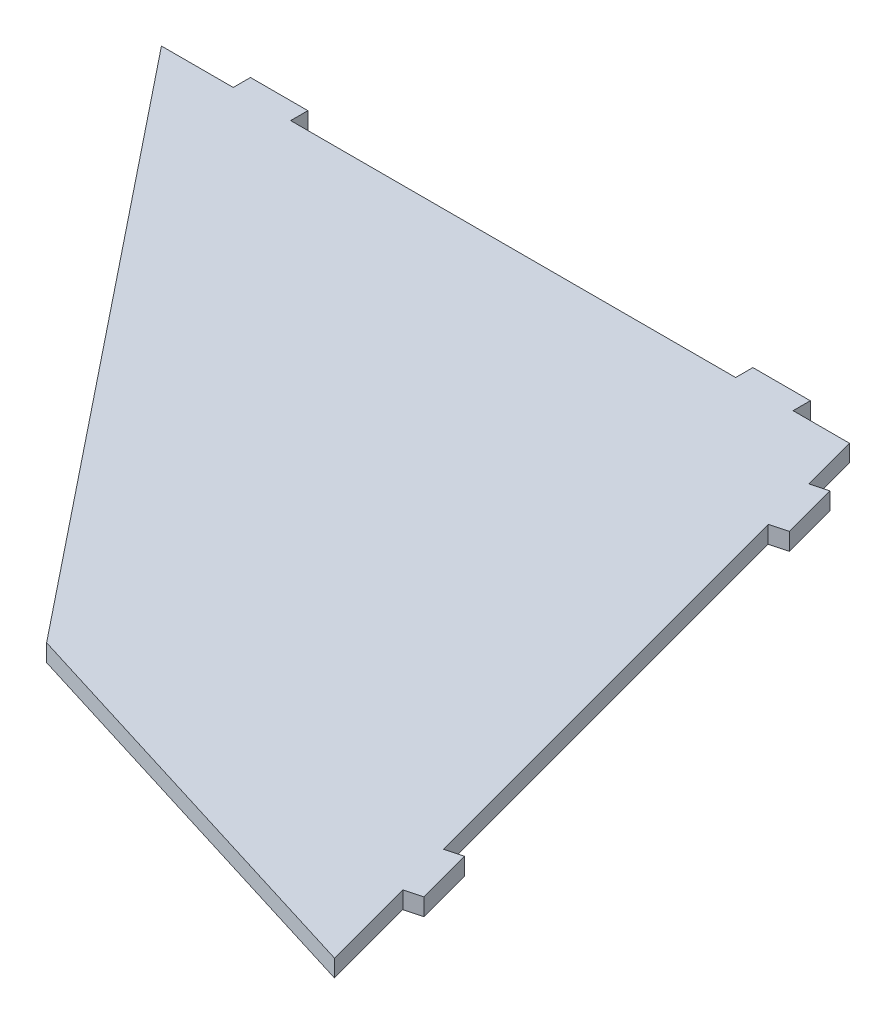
ISO-10303-21;
HEADER;
FILE_DESCRIPTION(('STEP AP214'),'2;1');
FILE_NAME('part.step','',(''),(''),'','','');
FILE_SCHEMA(('AUTOMOTIVE_DESIGN { 1 0 10303 214 1 1 1 1 }'));
ENDSEC;
DATA;
#1=APPLICATION_CONTEXT('core data for automotive mechanical design processes');
#2=APPLICATION_PROTOCOL_DEFINITION('international standard','automotive_design',2000,#1);
#3=PRODUCT_CONTEXT('',#1,'mechanical');
#4=PRODUCT('Part','Part','',(#3));
#5=PRODUCT_RELATED_PRODUCT_CATEGORY('part','',(#4));
#6=PRODUCT_DEFINITION_FORMATION('','',#4);
#7=PRODUCT_DEFINITION_CONTEXT('part definition',#1,'design');
#8=PRODUCT_DEFINITION('design','',#6,#7);
#9=PRODUCT_DEFINITION_SHAPE('','',#8);
#10=(LENGTH_UNIT() NAMED_UNIT(*) SI_UNIT(.MILLI.,.METRE.));
#11=(NAMED_UNIT(*) PLANE_ANGLE_UNIT() SI_UNIT($,.RADIAN.));
#12=(NAMED_UNIT(*) SI_UNIT($,.STERADIAN.) SOLID_ANGLE_UNIT());
#13=UNCERTAINTY_MEASURE_WITH_UNIT(LENGTH_MEASURE(1.E-05),#10,'distance_accuracy_value','');
#14=(GEOMETRIC_REPRESENTATION_CONTEXT(3) GLOBAL_UNCERTAINTY_ASSIGNED_CONTEXT((#13)) GLOBAL_UNIT_ASSIGNED_CONTEXT((#10,
#11,#12)) REPRESENTATION_CONTEXT('',''));
#15=CARTESIAN_POINT('',(0.,0.,0.));
#16=DIRECTION('',(0.,0.,1.));
#17=DIRECTION('',(1.,0.,0.));
#18=AXIS2_PLACEMENT_3D('',#15,#16,#17);
#19=CARTESIAN_POINT('',(90.5871781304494,6.,17.7656022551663));
#20=DIRECTION('',(0.258819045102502,0.,0.965925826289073));
#21=DIRECTION('',(0.965925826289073,0.,-0.258819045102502));
#22=AXIS2_PLACEMENT_3D('',#19,#20,#21);
#23=PLANE('',#22);
#24=DIRECTION('',(-0.965925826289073,0.,0.258819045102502));
#25=VECTOR('',#24,1.);
#26=CARTESIAN_POINT('',(90.5871781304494,0.,17.7656022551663));
#27=LINE('',#26,#25);
#28=CARTESIAN_POINT('',(90.5871781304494,0.,17.7656022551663));
#29=VERTEX_POINT('',#28);
#30=CARTESIAN_POINT('',(84.791623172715,0.,19.3185165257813));
#31=VERTEX_POINT('',#30);
#32=EDGE_CURVE('E201',#29,#31,#27,.T.);
#33=ORIENTED_EDGE('',*,*,#32,.T.);
#34=DIRECTION('',(0.,-1.,0.));
#35=VECTOR('',#34,1.);
#36=CARTESIAN_POINT('',(84.791623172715,6.,19.3185165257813));
#37=LINE('',#36,#35);
#38=CARTESIAN_POINT('',(84.791623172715,6.,19.3185165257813));
#39=VERTEX_POINT('',#38);
#40=EDGE_CURVE('E11',#39,#31,#37,.T.);
#41=ORIENTED_EDGE('',*,*,#40,.F.);
#42=DIRECTION('',(-0.965925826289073,0.,0.258819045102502));
#43=VECTOR('',#42,1.);
#44=CARTESIAN_POINT('',(90.5871781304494,6.,17.7656022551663));
#45=LINE('',#44,#43);
#46=CARTESIAN_POINT('',(90.5871781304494,6.,17.7656022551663));
#47=VERTEX_POINT('',#46);
#48=EDGE_CURVE('E239',#47,#39,#45,.T.);
#49=ORIENTED_EDGE('',*,*,#48,.F.);
#50=DIRECTION('',(0.,-1.,0.));
#51=VECTOR('',#50,1.);
#52=CARTESIAN_POINT('',(90.5871781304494,6.,17.7656022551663));
#53=LINE('',#52,#51);
#54=EDGE_CURVE('E197',#47,#29,#53,.T.);
#55=ORIENTED_EDGE('',*,*,#54,.T.);
#56=EDGE_LOOP('',(#33,#41,#49,#55));
#57=FACE_BOUND('',#56,.T.);
#58=ADVANCED_FACE('F33',(#57),#23,.F.);
#59=CARTESIAN_POINT('',(84.791623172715,6.,19.3185165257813));
#60=DIRECTION('',(-0.965925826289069,0.,0.258819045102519));
#61=DIRECTION('',(0.258819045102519,0.,0.965925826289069));
#62=AXIS2_PLACEMENT_3D('',#59,#60,#61);
#63=PLANE('',#62);
#64=DIRECTION('',(-0.258819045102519,0.,-0.965925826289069));
#65=VECTOR('',#64,1.);
#66=CARTESIAN_POINT('',(84.791623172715,0.,19.3185165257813));
#67=LINE('',#66,#65);
#68=CARTESIAN_POINT('',(79.6152422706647,0.,0.));
#69=VERTEX_POINT('',#68);
#70=EDGE_CURVE('E204',#31,#69,#67,.T.);
#71=ORIENTED_EDGE('',*,*,#70,.T.);
#72=DIRECTION('',(0.,-1.,0.));
#73=VECTOR('',#72,1.);
#74=CARTESIAN_POINT('',(79.6152422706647,6.,0.));
#75=LINE('',#74,#73);
#76=CARTESIAN_POINT('',(79.6152422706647,6.,0.));
#77=VERTEX_POINT('',#76);
#78=EDGE_CURVE('E41',#77,#69,#75,.T.);
#79=ORIENTED_EDGE('',*,*,#78,.F.);
#80=DIRECTION('',(-0.258819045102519,0.,-0.965925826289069));
#81=VECTOR('',#80,1.);
#82=CARTESIAN_POINT('',(84.791623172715,6.,19.3185165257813));
#83=LINE('',#82,#81);
#84=EDGE_CURVE('E128',#39,#77,#83,.T.);
#85=ORIENTED_EDGE('',*,*,#84,.F.);
#86=ORIENTED_EDGE('',*,*,#40,.T.);
#87=EDGE_LOOP('',(#71,#79,#85,#86));
#88=FACE_BOUND('',#87,.T.);
#89=ADVANCED_FACE('F357',(#88),#63,.F.);
#90=CARTESIAN_POINT('',(60.,6.,0.));
#91=DIRECTION('',(0.,0.,1.));
#92=DIRECTION('',(1.,0.,0.));
#93=AXIS2_PLACEMENT_3D('',#90,#91,#92);
#94=PLANE('',#93);
#95=DIRECTION('',(-1.,0.,0.));
#96=VECTOR('',#95,1.);
#97=CARTESIAN_POINT('',(60.,0.,0.));
#98=LINE('',#97,#96);
#99=CARTESIAN_POINT('',(60.,0.,0.));
#100=VERTEX_POINT('',#99);
#101=EDGE_CURVE('E206',#69,#100,#98,.T.);
#102=ORIENTED_EDGE('',*,*,#101,.T.);
#103=DIRECTION('',(0.,-1.,0.));
#104=VECTOR('',#103,1.);
#105=CARTESIAN_POINT('',(60.,6.,0.));
#106=LINE('',#105,#104);
#107=CARTESIAN_POINT('',(60.,6.,0.));
#108=VERTEX_POINT('',#107);
#109=EDGE_CURVE('E282',#108,#100,#106,.T.);
#110=ORIENTED_EDGE('',*,*,#109,.F.);
#111=DIRECTION('',(-1.,0.,0.));
#112=VECTOR('',#111,1.);
#113=CARTESIAN_POINT('',(60.,6.,0.));
#114=LINE('',#113,#112);
#115=EDGE_CURVE('E290',#77,#108,#114,.T.);
#116=ORIENTED_EDGE('',*,*,#115,.F.);
#117=ORIENTED_EDGE('',*,*,#78,.T.);
#118=EDGE_LOOP('',(#102,#110,#116,#117));
#119=FACE_BOUND('',#118,.T.);
#120=ADVANCED_FACE('F288',(#119),#94,.F.);
#121=CARTESIAN_POINT('',(60.,6.,0.));
#122=DIRECTION('',(-1.,0.,0.));
#123=DIRECTION('',(0.,0.,1.));
#124=AXIS2_PLACEMENT_3D('',#121,#122,#123);
#125=PLANE('',#124);
#126=DIRECTION('',(0.,0.,-1.));
#127=VECTOR('',#126,1.);
#128=CARTESIAN_POINT('',(60.,0.,0.));
#129=LINE('',#128,#127);
#130=CARTESIAN_POINT('',(60.,0.,-6.));
#131=VERTEX_POINT('',#130);
#132=EDGE_CURVE('E208',#100,#131,#129,.T.);
#133=ORIENTED_EDGE('',*,*,#132,.T.);
#134=DIRECTION('',(0.,-1.,0.));
#135=VECTOR('',#134,1.);
#136=CARTESIAN_POINT('',(60.,6.,-6.));
#137=LINE('',#136,#135);
#138=CARTESIAN_POINT('',(60.,6.,-6.));
#139=VERTEX_POINT('',#138);
#140=EDGE_CURVE('E279',#139,#131,#137,.T.);
#141=ORIENTED_EDGE('',*,*,#140,.F.);
#142=DIRECTION('',(0.,0.,-1.));
#143=VECTOR('',#142,1.);
#144=CARTESIAN_POINT('',(60.,6.,0.));
#145=LINE('',#144,#143);
#146=EDGE_CURVE('E308',#108,#139,#145,.T.);
#147=ORIENTED_EDGE('',*,*,#146,.F.);
#148=ORIENTED_EDGE('',*,*,#109,.T.);
#149=EDGE_LOOP('',(#133,#141,#147,#148));
#150=FACE_BOUND('',#149,.T.);
#151=ADVANCED_FACE('F299',(#150),#125,.F.);
#152=CARTESIAN_POINT('',(60.,6.,-6.));
#153=DIRECTION('',(0.,0.,1.));
#154=DIRECTION('',(1.,0.,0.));
#155=AXIS2_PLACEMENT_3D('',#152,#153,#154);
#156=PLANE('',#155);
#157=DIRECTION('',(-1.,0.,0.));
#158=VECTOR('',#157,1.);
#159=CARTESIAN_POINT('',(60.,0.,-6.));
#160=LINE('',#159,#158);
#161=CARTESIAN_POINT('',(40.,0.,-6.));
#162=VERTEX_POINT('',#161);
#163=EDGE_CURVE('E210',#131,#162,#160,.T.);
#164=ORIENTED_EDGE('',*,*,#163,.T.);
#165=DIRECTION('',(0.,-1.,0.));
#166=VECTOR('',#165,1.);
#167=CARTESIAN_POINT('',(40.,6.,-6.));
#168=LINE('',#167,#166);
#169=CARTESIAN_POINT('',(40.,6.,-6.));
#170=VERTEX_POINT('',#169);
#171=EDGE_CURVE('E276',#170,#162,#168,.T.);
#172=ORIENTED_EDGE('',*,*,#171,.F.);
#173=DIRECTION('',(-1.,0.,0.));
#174=VECTOR('',#173,1.);
#175=CARTESIAN_POINT('',(60.,6.,-6.));
#176=LINE('',#175,#174);
#177=EDGE_CURVE('E305',#139,#170,#176,.T.);
#178=ORIENTED_EDGE('',*,*,#177,.F.);
#179=ORIENTED_EDGE('',*,*,#140,.T.);
#180=EDGE_LOOP('',(#164,#172,#178,#179));
#181=FACE_BOUND('',#180,.T.);
#182=ADVANCED_FACE('F303',(#181),#156,.F.);
#183=CARTESIAN_POINT('',(40.,6.,0.));
#184=DIRECTION('',(1.,0.,0.));
#185=DIRECTION('',(0.,0.,-1.));
#186=AXIS2_PLACEMENT_3D('',#183,#184,#185);
#187=PLANE('',#186);
#188=DIRECTION('',(0.,0.,1.));
#189=VECTOR('',#188,1.);
#190=CARTESIAN_POINT('',(40.,0.,0.));
#191=LINE('',#190,#189);
#192=CARTESIAN_POINT('',(40.,0.,0.));
#193=VERTEX_POINT('',#192);
#194=EDGE_CURVE('E212',#162,#193,#191,.T.);
#195=ORIENTED_EDGE('',*,*,#194,.T.);
#196=DIRECTION('',(0.,-1.,0.));
#197=VECTOR('',#196,1.);
#198=CARTESIAN_POINT('',(40.,6.,0.));
#199=LINE('',#198,#197);
#200=CARTESIAN_POINT('',(40.,6.,0.));
#201=VERTEX_POINT('',#200);
#202=EDGE_CURVE('E273',#201,#193,#199,.T.);
#203=ORIENTED_EDGE('',*,*,#202,.F.);
#204=DIRECTION('',(0.,0.,1.));
#205=VECTOR('',#204,1.);
#206=CARTESIAN_POINT('',(40.,6.,0.));
#207=LINE('',#206,#205);
#208=EDGE_CURVE('E307',#170,#201,#207,.T.);
#209=ORIENTED_EDGE('',*,*,#208,.F.);
#210=ORIENTED_EDGE('',*,*,#171,.T.);
#211=EDGE_LOOP('',(#195,#203,#209,#210));
#212=FACE_BOUND('',#211,.T.);
#213=ADVANCED_FACE('F370',(#212),#187,.F.);
#214=CARTESIAN_POINT('',(-115.,6.,0.));
#215=DIRECTION('',(0.,0.,1.));
#216=DIRECTION('',(1.,0.,0.));
#217=AXIS2_PLACEMENT_3D('',#214,#215,#216);
#218=PLANE('',#217);
#219=DIRECTION('',(-1.,0.,0.));
#220=VECTOR('',#219,1.);
#221=CARTESIAN_POINT('',(-115.,0.,0.));
#222=LINE('',#221,#220);
#223=CARTESIAN_POINT('',(-115.,0.,0.));
#224=VERTEX_POINT('',#223);
#225=EDGE_CURVE('E214',#193,#224,#222,.T.);
#226=ORIENTED_EDGE('',*,*,#225,.T.);
#227=DIRECTION('',(0.,-1.,0.));
#228=VECTOR('',#227,1.);
#229=CARTESIAN_POINT('',(-115.,6.,0.));
#230=LINE('',#229,#228);
#231=CARTESIAN_POINT('',(-115.,6.,0.));
#232=VERTEX_POINT('',#231);
#233=EDGE_CURVE('E270',#232,#224,#230,.T.);
#234=ORIENTED_EDGE('',*,*,#233,.F.);
#235=DIRECTION('',(-1.,0.,0.));
#236=VECTOR('',#235,1.);
#237=CARTESIAN_POINT('',(-115.,6.,0.));
#238=LINE('',#237,#236);
#239=EDGE_CURVE('E310',#201,#232,#238,.T.);
#240=ORIENTED_EDGE('',*,*,#239,.F.);
#241=ORIENTED_EDGE('',*,*,#202,.T.);
#242=EDGE_LOOP('',(#226,#234,#240,#241));
#243=FACE_BOUND('',#242,.T.);
#244=ADVANCED_FACE('F373',(#243),#218,.F.);
#245=CARTESIAN_POINT('',(-115.,6.,0.));
#246=DIRECTION('',(-1.,0.,0.));
#247=DIRECTION('',(0.,0.,1.));
#248=AXIS2_PLACEMENT_3D('',#245,#246,#247);
#249=PLANE('',#248);
#250=DIRECTION('',(0.,0.,-1.));
#251=VECTOR('',#250,1.);
#252=CARTESIAN_POINT('',(-115.,0.,0.));
#253=LINE('',#252,#251);
#254=CARTESIAN_POINT('',(-115.,0.,-5.99999999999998));
#255=VERTEX_POINT('',#254);
#256=EDGE_CURVE('E216',#224,#255,#253,.T.);
#257=ORIENTED_EDGE('',*,*,#256,.T.);
#258=DIRECTION('',(0.,-1.,0.));
#259=VECTOR('',#258,1.);
#260=CARTESIAN_POINT('',(-115.,6.,-5.99999999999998));
#261=LINE('',#260,#259);
#262=CARTESIAN_POINT('',(-115.,6.,-5.99999999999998));
#263=VERTEX_POINT('',#262);
#264=EDGE_CURVE('E267',#263,#255,#261,.T.);
#265=ORIENTED_EDGE('',*,*,#264,.F.);
#266=DIRECTION('',(0.,0.,-1.));
#267=VECTOR('',#266,1.);
#268=CARTESIAN_POINT('',(-115.,6.,0.));
#269=LINE('',#268,#267);
#270=EDGE_CURVE('E316',#232,#263,#269,.T.);
#271=ORIENTED_EDGE('',*,*,#270,.F.);
#272=ORIENTED_EDGE('',*,*,#233,.T.);
#273=EDGE_LOOP('',(#257,#265,#271,#272));
#274=FACE_BOUND('',#273,.T.);
#275=ADVANCED_FACE('F377',(#274),#249,.F.);
#276=CARTESIAN_POINT('',(-135.,6.,-5.99999999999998));
#277=DIRECTION('',(0.,0.,1.));
#278=DIRECTION('',(1.,0.,0.));
#279=AXIS2_PLACEMENT_3D('',#276,#277,#278);
#280=PLANE('',#279);
#281=DIRECTION('',(-1.,0.,0.));
#282=VECTOR('',#281,1.);
#283=CARTESIAN_POINT('',(-135.,0.,-5.99999999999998));
#284=LINE('',#283,#282);
#285=CARTESIAN_POINT('',(-135.,0.,-5.99999999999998));
#286=VERTEX_POINT('',#285);
#287=EDGE_CURVE('E218',#255,#286,#284,.T.);
#288=ORIENTED_EDGE('',*,*,#287,.T.);
#289=DIRECTION('',(0.,-1.,0.));
#290=VECTOR('',#289,1.);
#291=CARTESIAN_POINT('',(-135.,6.,-5.99999999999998));
#292=LINE('',#291,#290);
#293=CARTESIAN_POINT('',(-135.,6.,-5.99999999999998));
#294=VERTEX_POINT('',#293);
#295=EDGE_CURVE('E264',#294,#286,#292,.T.);
#296=ORIENTED_EDGE('',*,*,#295,.F.);
#297=DIRECTION('',(-1.,0.,0.));
#298=VECTOR('',#297,1.);
#299=CARTESIAN_POINT('',(-135.,6.,-5.99999999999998));
#300=LINE('',#299,#298);
#301=EDGE_CURVE('E318',#263,#294,#300,.T.);
#302=ORIENTED_EDGE('',*,*,#301,.F.);
#303=ORIENTED_EDGE('',*,*,#264,.T.);
#304=EDGE_LOOP('',(#288,#296,#302,#303));
#305=FACE_BOUND('',#304,.T.);
#306=ADVANCED_FACE('F381',(#305),#280,.F.);
#307=CARTESIAN_POINT('',(-135.,6.,0.));
#308=DIRECTION('',(1.,0.,0.));
#309=DIRECTION('',(0.,0.,-1.));
#310=AXIS2_PLACEMENT_3D('',#307,#308,#309);
#311=PLANE('',#310);
#312=DIRECTION('',(0.,0.,1.));
#313=VECTOR('',#312,1.);
#314=CARTESIAN_POINT('',(-135.,0.,0.));
#315=LINE('',#314,#313);
#316=CARTESIAN_POINT('',(-135.,0.,0.));
#317=VERTEX_POINT('',#316);
#318=EDGE_CURVE('E220',#286,#317,#315,.T.);
#319=ORIENTED_EDGE('',*,*,#318,.T.);
#320=DIRECTION('',(0.,-1.,0.));
#321=VECTOR('',#320,1.);
#322=CARTESIAN_POINT('',(-135.,6.,0.));
#323=LINE('',#322,#321);
#324=CARTESIAN_POINT('',(-135.,6.,0.));
#325=VERTEX_POINT('',#324);
#326=EDGE_CURVE('E261',#325,#317,#323,.T.);
#327=ORIENTED_EDGE('',*,*,#326,.F.);
#328=DIRECTION('',(0.,0.,1.));
#329=VECTOR('',#328,1.);
#330=CARTESIAN_POINT('',(-135.,6.,0.));
#331=LINE('',#330,#329);
#332=EDGE_CURVE('E320',#294,#325,#331,.T.);
#333=ORIENTED_EDGE('',*,*,#332,.F.);
#334=ORIENTED_EDGE('',*,*,#295,.T.);
#335=EDGE_LOOP('',(#319,#327,#333,#334));
#336=FACE_BOUND('',#335,.T.);
#337=ADVANCED_FACE('F385',(#336),#311,.F.);
#338=CARTESIAN_POINT('',(-160.,6.,0.));
#339=DIRECTION('',(0.,0.,1.));
#340=DIRECTION('',(1.,0.,0.));
#341=AXIS2_PLACEMENT_3D('',#338,#339,#340);
#342=PLANE('',#341);
#343=DIRECTION('',(-1.,0.,0.));
#344=VECTOR('',#343,1.);
#345=CARTESIAN_POINT('',(-160.,0.,0.));
#346=LINE('',#345,#344);
#347=CARTESIAN_POINT('',(-160.,0.,0.));
#348=VERTEX_POINT('',#347);
#349=EDGE_CURVE('E222',#317,#348,#346,.T.);
#350=ORIENTED_EDGE('',*,*,#349,.T.);
#351=DIRECTION('',(0.,-1.,0.));
#352=VECTOR('',#351,1.);
#353=CARTESIAN_POINT('',(-160.,6.,0.));
#354=LINE('',#353,#352);
#355=CARTESIAN_POINT('',(-160.,6.,0.));
#356=VERTEX_POINT('',#355);
#357=EDGE_CURVE('E258',#356,#348,#354,.T.);
#358=ORIENTED_EDGE('',*,*,#357,.F.);
#359=DIRECTION('',(-1.,0.,0.));
#360=VECTOR('',#359,1.);
#361=CARTESIAN_POINT('',(-160.,6.,0.));
#362=LINE('',#361,#360);
#363=EDGE_CURVE('E322',#325,#356,#362,.T.);
#364=ORIENTED_EDGE('',*,*,#363,.F.);
#365=ORIENTED_EDGE('',*,*,#326,.T.);
#366=EDGE_LOOP('',(#350,#358,#364,#365));
#367=FACE_BOUND('',#366,.T.);
#368=ADVANCED_FACE('F389',(#367),#342,.F.);
#369=CARTESIAN_POINT('',(-160.,6.,0.));
#370=DIRECTION('',(0.78086880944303,0.,-0.624695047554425));
#371=DIRECTION('',(-0.624695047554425,0.,-0.78086880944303));
#372=AXIS2_PLACEMENT_3D('',#369,#370,#371);
#373=PLANE('',#372);
#374=DIRECTION('',(0.624695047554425,0.,0.78086880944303));
#375=VECTOR('',#374,1.);
#376=CARTESIAN_POINT('',(-160.,0.,0.));
#377=LINE('',#376,#375);
#378=CARTESIAN_POINT('',(0.,0.,200.));
#379=VERTEX_POINT('',#378);
#380=EDGE_CURVE('E224',#348,#379,#377,.T.);
#381=ORIENTED_EDGE('',*,*,#380,.T.);
#382=DIRECTION('',(0.,-1.,0.));
#383=VECTOR('',#382,1.);
#384=CARTESIAN_POINT('',(0.,6.,200.));
#385=LINE('',#384,#383);
#386=CARTESIAN_POINT('',(0.,6.,200.));
#387=VERTEX_POINT('',#386);
#388=EDGE_CURVE('E255',#387,#379,#385,.T.);
#389=ORIENTED_EDGE('',*,*,#388,.F.);
#390=DIRECTION('',(0.624695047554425,0.,0.78086880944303));
#391=VECTOR('',#390,1.);
#392=CARTESIAN_POINT('',(-160.,6.,0.));
#393=LINE('',#392,#391);
#394=EDGE_CURVE('E324',#356,#387,#393,.T.);
#395=ORIENTED_EDGE('',*,*,#394,.F.);
#396=ORIENTED_EDGE('',*,*,#357,.T.);
#397=EDGE_LOOP('',(#381,#389,#395,#396));
#398=FACE_BOUND('',#397,.T.);
#399=ADVANCED_FACE('F393',(#398),#373,.F.);
#400=CARTESIAN_POINT('',(0.,6.,200.));
#401=DIRECTION('',(0.295909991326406,0.,-0.95521582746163));
#402=DIRECTION('',(-0.95521582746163,0.,-0.295909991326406));
#403=AXIS2_PLACEMENT_3D('',#400,#401,#402);
#404=PLANE('',#403);
#405=DIRECTION('',(0.95521582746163,0.,0.295909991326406));
#406=VECTOR('',#405,1.);
#407=CARTESIAN_POINT('',(0.,0.,200.));
#408=LINE('',#407,#406);
#409=CARTESIAN_POINT('',(145.262794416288,0.,245.));
#410=VERTEX_POINT('',#409);
#411=EDGE_CURVE('E226',#379,#410,#408,.T.);
#412=ORIENTED_EDGE('',*,*,#411,.T.);
#413=DIRECTION('',(0.,-1.,0.));
#414=VECTOR('',#413,1.);
#415=CARTESIAN_POINT('',(145.262794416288,6.,245.));
#416=LINE('',#415,#414);
#417=CARTESIAN_POINT('',(145.262794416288,6.,245.));
#418=VERTEX_POINT('',#417);
#419=EDGE_CURVE('E252',#418,#410,#416,.T.);
#420=ORIENTED_EDGE('',*,*,#419,.F.);
#421=DIRECTION('',(0.95521582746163,0.,0.295909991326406));
#422=VECTOR('',#421,1.);
#423=CARTESIAN_POINT('',(0.,6.,200.));
#424=LINE('',#423,#422);
#425=EDGE_CURVE('E326',#387,#418,#424,.T.);
#426=ORIENTED_EDGE('',*,*,#425,.F.);
#427=ORIENTED_EDGE('',*,*,#388,.T.);
#428=EDGE_LOOP('',(#412,#420,#426,#427));
#429=FACE_BOUND('',#428,.T.);
#430=ADVANCED_FACE('F397',(#429),#404,.F.);
#431=CARTESIAN_POINT('',(145.262794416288,6.,245.));
#432=DIRECTION('',(-0.965925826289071,0.,0.258819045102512));
#433=DIRECTION('',(0.258819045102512,0.,0.965925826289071));
#434=AXIS2_PLACEMENT_3D('',#431,#432,#433);
#435=PLANE('',#434);
#436=DIRECTION('',(-0.258819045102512,0.,-0.965925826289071));
#437=VECTOR('',#436,1.);
#438=CARTESIAN_POINT('',(145.262794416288,0.,245.));
#439=LINE('',#438,#437);
#440=CARTESIAN_POINT('',(136.555432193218,0.,212.503681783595));
#441=VERTEX_POINT('',#440);
#442=EDGE_CURVE('E228',#410,#441,#439,.T.);
#443=ORIENTED_EDGE('',*,*,#442,.T.);
#444=DIRECTION('',(0.,-1.,0.));
#445=VECTOR('',#444,1.);
#446=CARTESIAN_POINT('',(136.555432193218,6.,212.503681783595));
#447=LINE('',#446,#445);
#448=CARTESIAN_POINT('',(136.555432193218,6.,212.503681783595));
#449=VERTEX_POINT('',#448);
#450=EDGE_CURVE('E249',#449,#441,#447,.T.);
#451=ORIENTED_EDGE('',*,*,#450,.F.);
#452=DIRECTION('',(-0.258819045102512,0.,-0.965925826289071));
#453=VECTOR('',#452,1.);
#454=CARTESIAN_POINT('',(145.262794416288,6.,245.));
#455=LINE('',#454,#453);
#456=EDGE_CURVE('E328',#418,#449,#455,.T.);
#457=ORIENTED_EDGE('',*,*,#456,.F.);
#458=ORIENTED_EDGE('',*,*,#419,.T.);
#459=EDGE_LOOP('',(#443,#451,#457,#458));
#460=FACE_BOUND('',#459,.T.);
#461=ADVANCED_FACE('F401',(#460),#435,.F.);
#462=CARTESIAN_POINT('',(142.350987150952,6.,210.95076751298));
#463=DIRECTION('',(-0.258819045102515,0.,-0.96592582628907));
#464=DIRECTION('',(-0.96592582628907,0.,0.258819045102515));
#465=AXIS2_PLACEMENT_3D('',#462,#463,#464);
#466=PLANE('',#465);
#467=DIRECTION('',(0.96592582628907,0.,-0.258819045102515));
#468=VECTOR('',#467,1.);
#469=CARTESIAN_POINT('',(142.350987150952,0.,210.95076751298));
#470=LINE('',#469,#468);
#471=CARTESIAN_POINT('',(142.350987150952,0.,210.95076751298));
#472=VERTEX_POINT('',#471);
#473=EDGE_CURVE('E230',#441,#472,#470,.T.);
#474=ORIENTED_EDGE('',*,*,#473,.T.);
#475=DIRECTION('',(0.,-1.,0.));
#476=VECTOR('',#475,1.);
#477=CARTESIAN_POINT('',(142.350987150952,6.,210.95076751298));
#478=LINE('',#477,#476);
#479=CARTESIAN_POINT('',(142.350987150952,6.,210.95076751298));
#480=VERTEX_POINT('',#479);
#481=EDGE_CURVE('E246',#480,#472,#478,.T.);
#482=ORIENTED_EDGE('',*,*,#481,.F.);
#483=DIRECTION('',(0.96592582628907,0.,-0.258819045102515));
#484=VECTOR('',#483,1.);
#485=CARTESIAN_POINT('',(142.350987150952,6.,210.95076751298));
#486=LINE('',#485,#484);
#487=EDGE_CURVE('E330',#449,#480,#486,.T.);
#488=ORIENTED_EDGE('',*,*,#487,.F.);
#489=ORIENTED_EDGE('',*,*,#450,.T.);
#490=EDGE_LOOP('',(#474,#482,#488,#489));
#491=FACE_BOUND('',#490,.T.);
#492=ADVANCED_FACE('F405',(#491),#466,.F.);
#493=CARTESIAN_POINT('',(137.174606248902,6.,191.632250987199));
#494=DIRECTION('',(-0.96592582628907,0.,0.258819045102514));
#495=DIRECTION('',(0.258819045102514,0.,0.96592582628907));
#496=AXIS2_PLACEMENT_3D('',#493,#494,#495);
#497=PLANE('',#496);
#498=DIRECTION('',(-0.258819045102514,0.,-0.96592582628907));
#499=VECTOR('',#498,1.);
#500=CARTESIAN_POINT('',(137.174606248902,0.,191.632250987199));
#501=LINE('',#500,#499);
#502=CARTESIAN_POINT('',(137.174606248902,0.,191.632250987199));
#503=VERTEX_POINT('',#502);
#504=EDGE_CURVE('E232',#472,#503,#501,.T.);
#505=ORIENTED_EDGE('',*,*,#504,.T.);
#506=DIRECTION('',(0.,-1.,0.));
#507=VECTOR('',#506,1.);
#508=CARTESIAN_POINT('',(137.174606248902,6.,191.632250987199));
#509=LINE('',#508,#507);
#510=CARTESIAN_POINT('',(137.174606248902,6.,191.632250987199));
#511=VERTEX_POINT('',#510);
#512=EDGE_CURVE('E243',#511,#503,#509,.T.);
#513=ORIENTED_EDGE('',*,*,#512,.F.);
#514=DIRECTION('',(-0.258819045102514,0.,-0.96592582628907));
#515=VECTOR('',#514,1.);
#516=CARTESIAN_POINT('',(137.174606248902,6.,191.632250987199));
#517=LINE('',#516,#515);
#518=EDGE_CURVE('E332',#480,#511,#517,.T.);
#519=ORIENTED_EDGE('',*,*,#518,.F.);
#520=ORIENTED_EDGE('',*,*,#481,.T.);
#521=EDGE_LOOP('',(#505,#513,#519,#520));
#522=FACE_BOUND('',#521,.T.);
#523=ADVANCED_FACE('F338',(#522),#497,.F.);
#524=CARTESIAN_POINT('',(137.174606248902,6.,191.632250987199));
#525=DIRECTION('',(0.258819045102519,0.,0.965925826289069));
#526=DIRECTION('',(0.965925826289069,0.,-0.258819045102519));
#527=AXIS2_PLACEMENT_3D('',#524,#525,#526);
#528=PLANE('',#527);
#529=DIRECTION('',(-0.965925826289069,0.,0.258819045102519));
#530=VECTOR('',#529,1.);
#531=CARTESIAN_POINT('',(137.174606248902,0.,191.632250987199));
#532=LINE('',#531,#530);
#533=CARTESIAN_POINT('',(131.379051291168,0.,193.185165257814));
#534=VERTEX_POINT('',#533);
#535=EDGE_CURVE('E234',#503,#534,#532,.T.);
#536=ORIENTED_EDGE('',*,*,#535,.T.);
#537=DIRECTION('',(0.,-1.,0.));
#538=VECTOR('',#537,1.);
#539=CARTESIAN_POINT('',(131.379051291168,6.,193.185165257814));
#540=LINE('',#539,#538);
#541=CARTESIAN_POINT('',(131.379051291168,6.,193.185165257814));
#542=VERTEX_POINT('',#541);
#543=EDGE_CURVE('E192',#542,#534,#540,.T.);
#544=ORIENTED_EDGE('',*,*,#543,.F.);
#545=DIRECTION('',(-0.965925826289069,0.,0.258819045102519));
#546=VECTOR('',#545,1.);
#547=CARTESIAN_POINT('',(137.174606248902,6.,191.632250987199));
#548=LINE('',#547,#546);
#549=EDGE_CURVE('E183',#511,#542,#548,.T.);
#550=ORIENTED_EDGE('',*,*,#549,.F.);
#551=ORIENTED_EDGE('',*,*,#512,.T.);
#552=EDGE_LOOP('',(#536,#544,#550,#551));
#553=FACE_BOUND('',#552,.T.);
#554=ADVANCED_FACE('F342',(#553),#528,.F.);
#555=CARTESIAN_POINT('',(131.379051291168,6.,193.185165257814));
#556=DIRECTION('',(-0.96592582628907,0.,0.258819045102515));
#557=DIRECTION('',(0.258819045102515,0.,0.96592582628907));
#558=AXIS2_PLACEMENT_3D('',#555,#556,#557);
#559=PLANE('',#558);
#560=DIRECTION('',(-0.258819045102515,0.,-0.96592582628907));
#561=VECTOR('',#560,1.);
#562=CARTESIAN_POINT('',(131.379051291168,0.,193.185165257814));
#563=LINE('',#562,#561);
#564=CARTESIAN_POINT('',(89.9680040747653,0.,38.6370330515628));
#565=VERTEX_POINT('',#564);
#566=EDGE_CURVE('E191',#534,#565,#563,.T.);
#567=ORIENTED_EDGE('',*,*,#566,.T.);
#568=DIRECTION('',(0.,-1.,0.));
#569=VECTOR('',#568,1.);
#570=CARTESIAN_POINT('',(89.9680040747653,6.,38.6370330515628));
#571=LINE('',#570,#569);
#572=CARTESIAN_POINT('',(89.9680040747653,6.,38.6370330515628));
#573=VERTEX_POINT('',#572);
#574=EDGE_CURVE('E188',#573,#565,#571,.T.);
#575=ORIENTED_EDGE('',*,*,#574,.F.);
#576=DIRECTION('',(-0.258819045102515,0.,-0.96592582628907));
#577=VECTOR('',#576,1.);
#578=CARTESIAN_POINT('',(131.379051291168,6.,193.185165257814));
#579=LINE('',#578,#577);
#580=EDGE_CURVE('E177',#542,#573,#579,.T.);
#581=ORIENTED_EDGE('',*,*,#580,.F.);
#582=ORIENTED_EDGE('',*,*,#543,.T.);
#583=EDGE_LOOP('',(#567,#575,#581,#582));
#584=FACE_BOUND('',#583,.T.);
#585=ADVANCED_FACE('F189',(#584),#559,.F.);
#586=CARTESIAN_POINT('',(95.7635590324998,6.,37.0841187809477));
#587=DIRECTION('',(-0.258819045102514,0.,-0.96592582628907));
#588=DIRECTION('',(-0.96592582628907,0.,0.258819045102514));
#589=AXIS2_PLACEMENT_3D('',#586,#587,#588);
#590=PLANE('',#589);
#591=DIRECTION('',(0.96592582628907,0.,-0.258819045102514));
#592=VECTOR('',#591,1.);
#593=CARTESIAN_POINT('',(95.7635590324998,0.,37.0841187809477));
#594=LINE('',#593,#592);
#595=CARTESIAN_POINT('',(95.7635590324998,0.,37.0841187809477));
#596=VERTEX_POINT('',#595);
#597=EDGE_CURVE('E114',#565,#596,#594,.T.);
#598=ORIENTED_EDGE('',*,*,#597,.T.);
#599=DIRECTION('',(0.,-1.,0.));
#600=VECTOR('',#599,1.);
#601=CARTESIAN_POINT('',(95.7635590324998,6.,37.0841187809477));
#602=LINE('',#601,#600);
#603=CARTESIAN_POINT('',(95.7635590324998,6.,37.0841187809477));
#604=VERTEX_POINT('',#603);
#605=EDGE_CURVE('E193',#604,#596,#602,.T.);
#606=ORIENTED_EDGE('',*,*,#605,.F.);
#607=DIRECTION('',(0.96592582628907,0.,-0.258819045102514));
#608=VECTOR('',#607,1.);
#609=CARTESIAN_POINT('',(95.7635590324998,6.,37.0841187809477));
#610=LINE('',#609,#608);
#611=EDGE_CURVE('E181',#573,#604,#610,.T.);
#612=ORIENTED_EDGE('',*,*,#611,.F.);
#613=ORIENTED_EDGE('',*,*,#574,.T.);
#614=EDGE_LOOP('',(#598,#606,#612,#613));
#615=FACE_BOUND('',#614,.T.);
#616=ADVANCED_FACE('F195',(#615),#590,.F.);
#617=CARTESIAN_POINT('',(90.5871781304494,6.,17.7656022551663));
#618=DIRECTION('',(-0.96592582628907,0.,0.258819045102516));
#619=DIRECTION('',(0.258819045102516,0.,0.96592582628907));
#620=AXIS2_PLACEMENT_3D('',#617,#618,#619);
#621=PLANE('',#620);
#622=DIRECTION('',(-0.258819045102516,0.,-0.96592582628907));
#623=VECTOR('',#622,1.);
#624=CARTESIAN_POINT('',(90.5871781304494,0.,17.7656022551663));
#625=LINE('',#624,#623);
#626=EDGE_CURVE('E120',#596,#29,#625,.T.);
#627=ORIENTED_EDGE('',*,*,#626,.T.);
#628=ORIENTED_EDGE('',*,*,#54,.F.);
#629=DIRECTION('',(-0.258819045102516,0.,-0.96592582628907));
#630=VECTOR('',#629,1.);
#631=CARTESIAN_POINT('',(90.5871781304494,6.,17.7656022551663));
#632=LINE('',#631,#630);
#633=EDGE_CURVE('E49',#604,#47,#632,.T.);
#634=ORIENTED_EDGE('',*,*,#633,.F.);
#635=ORIENTED_EDGE('',*,*,#605,.T.);
#636=EDGE_LOOP('',(#627,#628,#634,#635));
#637=FACE_BOUND('',#636,.T.);
#638=ADVANCED_FACE('F346',(#637),#621,.F.);
#639=CARTESIAN_POINT('',(0.,6.,0.));
#640=DIRECTION('',(0.,-1.,0.));
#641=DIRECTION('',(0.,0.,-1.));
#642=AXIS2_PLACEMENT_3D('',#639,#640,#641);
#643=PLANE('',#642);
#644=ORIENTED_EDGE('',*,*,#48,.T.);
#645=ORIENTED_EDGE('',*,*,#84,.T.);
#646=ORIENTED_EDGE('',*,*,#115,.T.);
#647=ORIENTED_EDGE('',*,*,#146,.T.);
#648=ORIENTED_EDGE('',*,*,#177,.T.);
#649=ORIENTED_EDGE('',*,*,#208,.T.);
#650=ORIENTED_EDGE('',*,*,#239,.T.);
#651=ORIENTED_EDGE('',*,*,#270,.T.);
#652=ORIENTED_EDGE('',*,*,#301,.T.);
#653=ORIENTED_EDGE('',*,*,#332,.T.);
#654=ORIENTED_EDGE('',*,*,#363,.T.);
#655=ORIENTED_EDGE('',*,*,#394,.T.);
#656=ORIENTED_EDGE('',*,*,#425,.T.);
#657=ORIENTED_EDGE('',*,*,#456,.T.);
#658=ORIENTED_EDGE('',*,*,#487,.T.);
#659=ORIENTED_EDGE('',*,*,#518,.T.);
#660=ORIENTED_EDGE('',*,*,#549,.T.);
#661=ORIENTED_EDGE('',*,*,#580,.T.);
#662=ORIENTED_EDGE('',*,*,#611,.T.);
#663=ORIENTED_EDGE('',*,*,#633,.T.);
#664=EDGE_LOOP('',(#644,#645,#646,#647,#648,#649,#650,#651,#652,#653,#654,#655,#656,#657,#658,
#659,#660,#661,#662,#663));
#665=FACE_BOUND('',#664,.T.);
#666=ADVANCED_FACE('F179',(#665),#643,.F.);
#667=CARTESIAN_POINT('',(0.,0.,0.));
#668=DIRECTION('',(0.,-1.,0.));
#669=DIRECTION('',(0.,0.,-1.));
#670=AXIS2_PLACEMENT_3D('',#667,#668,#669);
#671=PLANE('',#670);
#672=ORIENTED_EDGE('',*,*,#32,.F.);
#673=ORIENTED_EDGE('',*,*,#626,.F.);
#674=ORIENTED_EDGE('',*,*,#597,.F.);
#675=ORIENTED_EDGE('',*,*,#566,.F.);
#676=ORIENTED_EDGE('',*,*,#535,.F.);
#677=ORIENTED_EDGE('',*,*,#504,.F.);
#678=ORIENTED_EDGE('',*,*,#473,.F.);
#679=ORIENTED_EDGE('',*,*,#442,.F.);
#680=ORIENTED_EDGE('',*,*,#411,.F.);
#681=ORIENTED_EDGE('',*,*,#380,.F.);
#682=ORIENTED_EDGE('',*,*,#349,.F.);
#683=ORIENTED_EDGE('',*,*,#318,.F.);
#684=ORIENTED_EDGE('',*,*,#287,.F.);
#685=ORIENTED_EDGE('',*,*,#256,.F.);
#686=ORIENTED_EDGE('',*,*,#225,.F.);
#687=ORIENTED_EDGE('',*,*,#194,.F.);
#688=ORIENTED_EDGE('',*,*,#163,.F.);
#689=ORIENTED_EDGE('',*,*,#132,.F.);
#690=ORIENTED_EDGE('',*,*,#101,.F.);
#691=ORIENTED_EDGE('',*,*,#70,.F.);
#692=EDGE_LOOP('',(#672,#673,#674,#675,#676,#677,#678,#679,#680,#681,#682,#683,#684,#685,#686,
#687,#688,#689,#690,#691));
#693=FACE_BOUND('',#692,.T.);
#694=ADVANCED_FACE('F294',(#693),#671,.T.);
#695=CLOSED_SHELL('',(#58,#89,#120,#151,#182,#213,#244,#275,#306,#337,#368,#399,#430,#461,#492,
#523,#554,#585,#616,#638,#666,#694));
#696=MANIFOLD_SOLID_BREP('B2',#695);
#697=ADVANCED_BREP_SHAPE_REPRESENTATION('',(#18,#696),#14);
#698=SHAPE_DEFINITION_REPRESENTATION(#9,#697);
ENDSEC;
END-ISO-10303-21;
